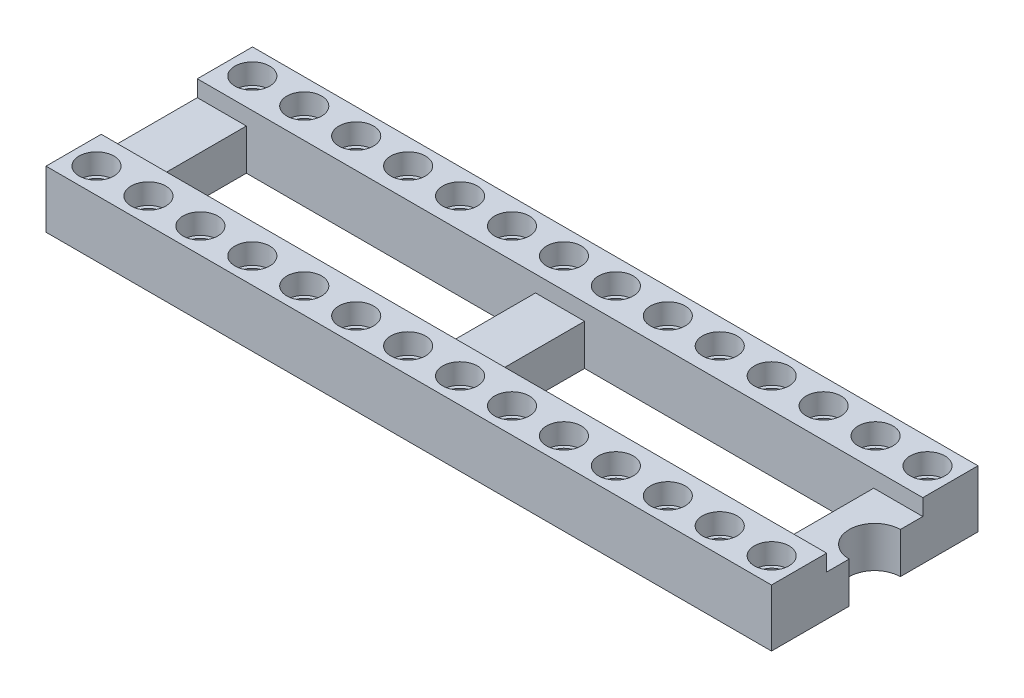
from build123d import *

# Parameters (mm, degrees)
BOSS_EXTRUDE1_DEPTH  = 17.74
SKETCH2_W            = 14.14
SKETCH2_H            = 4.7
CUT_EXTRUDE1_DEPTH   = 35.5
SKETCH3_R            = 1.25
CUT_EXTRUDE2_DEPTH   = 35.5
HOLE_D               = 1.35
HOLE_CBORE_D         = 1.7
HOLE_CBORE_DEPTH     = 1
LPATTERN1_COUNT      = 14
LPATTERN1_PITCH      = 2.54
LPATTERN1_COUNT_DIR2 = 2
LPATTERN1_PITCH_DIR2 = 7.62


with BuildPart() as part:
    # Sketch1 → Boss-Extrude1 (new, symmetric)
    with BuildSketch(Plane(origin=(0, 0, 0), x_dir=(0, 0, -1), z_dir=(1, 0, 0))):
        Polygon((-5.05, 0), (5.05, 0), (5.05, 2.8), (2.35, 2.8), (2.35, 2), (-2.35, 2), (-2.35, 2.8), (-5.05, 2.8), align=None)
    extrude(amount=BOSS_EXTRUDE1_DEPTH, both=True)

    # Sketch2 → Cut-Extrude1 (cut)
    with BuildSketch(Plane(origin=(0, 2, 0), x_dir=(1, 0, 0), z_dir=(0, 1, 0))):
        with Locations((-8.27, 0)):
            Rectangle(SKETCH2_W, SKETCH2_H)
        with Locations((8.27, 0)):
            Rectangle(SKETCH2_W, SKETCH2_H)
    extrude(amount=-CUT_EXTRUDE1_DEPTH, mode=Mode.SUBTRACT)

    # Sketch3 → Cut-Extrude2 (cut)
    with BuildSketch(Plane(origin=(0, 2, 0), x_dir=(1, 0, 0), z_dir=(0, 1, 0))):
        with Locations((17.74, 0)):
            Circle(SKETCH3_R)
    extrude(amount=-CUT_EXTRUDE2_DEPTH, mode=Mode.SUBTRACT)

    # hole (through all)
    with Locations(Plane(origin=(0, 2.8, 0), x_dir=(1, 0, 0), z_dir=(0, 1, 0))):
        with Locations((16.51, 3.81)):
            hole = CounterBoreHole(HOLE_D / 2, HOLE_CBORE_D / 2, HOLE_CBORE_DEPTH)

    # LPattern1: hole 14 × 2
    with Locations(*[(-i * LPATTERN1_PITCH, 0, j * LPATTERN1_PITCH_DIR2) for i in range(LPATTERN1_COUNT) for j in range(LPATTERN1_COUNT_DIR2) if (i, j) != (0, 0)]):
        add(hole, mode=Mode.SUBTRACT)


solid = part.part
